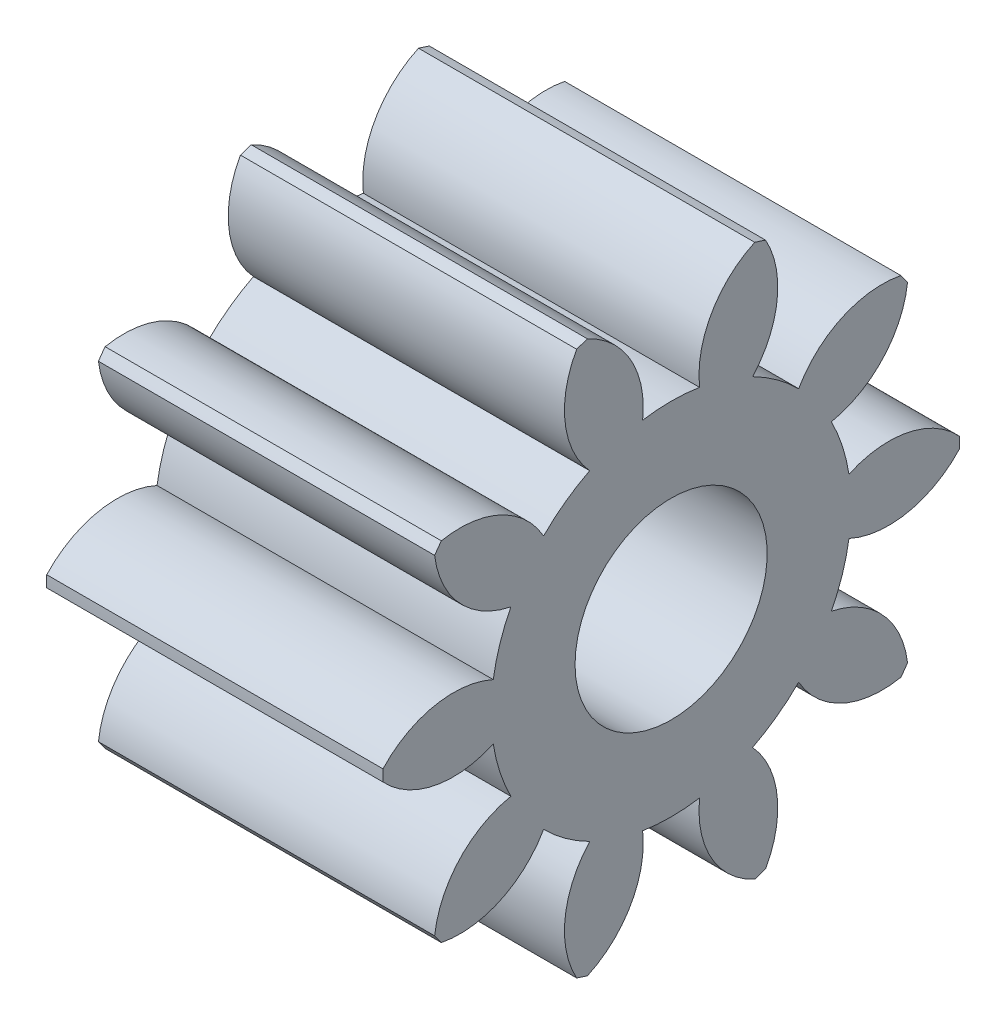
ISO-10303-21;
HEADER;
FILE_DESCRIPTION(('STEP AP214'),'2;1');
FILE_NAME('part.step','',(''),(''),'','','');
FILE_SCHEMA(('AUTOMOTIVE_DESIGN { 1 0 10303 214 1 1 1 1 }'));
ENDSEC;
DATA;
#1=APPLICATION_CONTEXT('core data for automotive mechanical design processes');
#2=APPLICATION_PROTOCOL_DEFINITION('international standard','automotive_design',2000,#1);
#3=PRODUCT_CONTEXT('',#1,'mechanical');
#4=PRODUCT('Part','Part','',(#3));
#5=PRODUCT_RELATED_PRODUCT_CATEGORY('part','',(#4));
#6=PRODUCT_DEFINITION_FORMATION('','',#4);
#7=PRODUCT_DEFINITION_CONTEXT('part definition',#1,'design');
#8=PRODUCT_DEFINITION('design','',#6,#7);
#9=PRODUCT_DEFINITION_SHAPE('','',#8);
#10=(LENGTH_UNIT() NAMED_UNIT(*) SI_UNIT(.MILLI.,.METRE.));
#11=(NAMED_UNIT(*) PLANE_ANGLE_UNIT() SI_UNIT($,.RADIAN.));
#12=(NAMED_UNIT(*) SI_UNIT($,.STERADIAN.) SOLID_ANGLE_UNIT());
#13=UNCERTAINTY_MEASURE_WITH_UNIT(LENGTH_MEASURE(1.E-05),#10,'distance_accuracy_value','');
#14=(GEOMETRIC_REPRESENTATION_CONTEXT(3) GLOBAL_UNCERTAINTY_ASSIGNED_CONTEXT((#13)) GLOBAL_UNIT_ASSIGNED_CONTEXT((#10,
#11,#12)) REPRESENTATION_CONTEXT('',''));
#15=CARTESIAN_POINT('',(0.,0.,0.));
#16=DIRECTION('',(0.,0.,1.));
#17=DIRECTION('',(1.,0.,0.));
#18=AXIS2_PLACEMENT_3D('',#15,#16,#17);
#19=CARTESIAN_POINT('',(3.5,0.,0.));
#20=DIRECTION('',(-1.,0.,0.));
#21=DIRECTION('',(0.,0.,1.));
#22=AXIS2_PLACEMENT_3D('',#19,#20,#21);
#23=PLANE('',#22);
#24=CARTESIAN_POINT('',(3.5,0.,0.));
#25=DIRECTION('',(-1.,0.,0.));
#26=DIRECTION('',(0.,0.,1.));
#27=AXIS2_PLACEMENT_3D('',#24,#25,#26);
#28=CIRCLE('',#27,1.);
#29=CARTESIAN_POINT('',(3.5,0.,1.));
#30=VERTEX_POINT('',#29);
#31=EDGE_CURVE('E352',#30,#30,#28,.F.);
#32=ORIENTED_EDGE('',*,*,#31,.F.);
#33=EDGE_LOOP('',(#32));
#34=FACE_BOUND('',#33,.T.);
#35=CARTESIAN_POINT('',(3.5,-0.62021278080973,-2.26588282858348));
#36=DIRECTION('',(-1.,0.,0.));
#37=DIRECTION('',(0.,-0.95105651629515,-0.309016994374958));
#38=AXIS2_PLACEMENT_3D('',#35,#36,#37);
#39=CIRCLE('',#38,0.999999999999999);
#40=CARTESIAN_POINT('',(3.5,0.289865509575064,-1.85144645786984));
#41=VERTEX_POINT('',#40);
#42=CARTESIAN_POINT('',(3.5,0.0594463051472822,-2.99941096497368));
#43=VERTEX_POINT('',#42);
#44=EDGE_CURVE('E358',#41,#43,#39,.T.);
#45=ORIENTED_EDGE('',*,*,#44,.F.);
#46=CARTESIAN_POINT('',(3.5,0.,0.));
#47=DIRECTION('',(-1.,0.,0.));
#48=DIRECTION('',(0.,-0.95105651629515,-0.309016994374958));
#49=AXIS2_PLACEMENT_3D('',#46,#47,#48);
#50=CIRCLE('',#49,1.874);
#51=CARTESIAN_POINT('',(3.5,0.85374680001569,-1.66823032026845));
#52=VERTEX_POINT('',#51);
#53=EDGE_CURVE('E363',#52,#41,#50,.T.);
#54=ORIENTED_EDGE('',*,*,#53,.F.);
#55=CARTESIAN_POINT('',(3.5,1.83361518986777,-1.46858578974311));
#56=DIRECTION('',(-1.,0.,0.));
#57=DIRECTION('',(0.,-0.95105651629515,-0.309016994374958));
#58=AXIS2_PLACEMENT_3D('',#55,#56,#57);
#59=CIRCLE('',#58,1.);
#60=CARTESIAN_POINT('',(3.5,1.71491645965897,-2.46151610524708));
#61=VERTEX_POINT('',#60);
#62=EDGE_CURVE('E360',#61,#52,#59,.T.);
#63=ORIENTED_EDGE('',*,*,#62,.F.);
#64=CARTESIAN_POINT('',(3.5,0.,0.));
#65=DIRECTION('',(-1.,0.,0.));
#66=DIRECTION('',(0.,0.,1.));
#67=AXIS2_PLACEMENT_3D('',#64,#65,#66);
#68=CIRCLE('',#67,3.);
#69=CARTESIAN_POINT('',(3.5,1.81110260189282,-2.39163278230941));
#70=VERTEX_POINT('',#69);
#71=EDGE_CURVE('E524',#70,#61,#68,.T.);
#72=ORIENTED_EDGE('',*,*,#71,.F.);
#73=CARTESIAN_POINT('',(3.5,0.830089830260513,-2.19768964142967));
#74=DIRECTION('',(-1.,0.,0.));
#75=DIRECTION('',(0.,-0.587785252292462,-0.809016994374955));
#76=AXIS2_PLACEMENT_3D('',#73,#74,#75);
#77=CIRCLE('',#76,0.999999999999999);
#78=CARTESIAN_POINT('',(3.5,1.32275904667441,-1.32747297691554));
#79=VERTEX_POINT('',#78);
#80=EDGE_CURVE('E343',#79,#70,#77,.T.);
#81=ORIENTED_EDGE('',*,*,#80,.F.);
#82=CARTESIAN_POINT('',(3.5,0.,0.));
#83=DIRECTION('',(-1.,0.,0.));
#84=DIRECTION('',(0.,-0.587785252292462,-0.809016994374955));
#85=AXIS2_PLACEMENT_3D('',#82,#83,#84);
#86=CIRCLE('',#85,1.874);
#87=CARTESIAN_POINT('',(3.5,1.67125684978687,-0.84780690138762));
#88=VERTEX_POINT('',#87);
#89=EDGE_CURVE('E348',#88,#79,#86,.T.);
#90=ORIENTED_EDGE('',*,*,#89,.F.);
#91=CARTESIAN_POINT('',(3.5,2.34663891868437,-0.110338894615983));
#92=DIRECTION('',(-1.,0.,0.));
#93=DIRECTION('',(0.,-0.587785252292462,-0.809016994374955));
#94=AXIS2_PLACEMENT_3D('',#91,#92,#93);
#95=CIRCLE('',#94,1.);
#96=CARTESIAN_POINT('',(3.5,2.83423942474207,-0.983405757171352));
#97=VERTEX_POINT('',#96);
#98=EDGE_CURVE('E345',#97,#88,#95,.T.);
#99=ORIENTED_EDGE('',*,*,#98,.F.);
#100=CARTESIAN_POINT('',(3.5,2.87097926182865,-0.870332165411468));
#101=VERTEX_POINT('',#100);
#102=EDGE_CURVE('E520',#101,#97,#68,.T.);
#103=ORIENTED_EDGE('',*,*,#102,.F.);
#104=CARTESIAN_POINT('',(3.5,1.96332633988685,-1.29005370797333));
#105=DIRECTION('',(-1.,0.,0.));
#106=DIRECTION('',(0.,0.,-1.));
#107=AXIS2_PLACEMENT_3D('',#104,#105,#106);
#108=CIRCLE('',#107,0.999999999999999);
#109=CARTESIAN_POINT('',(3.5,1.85040358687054,-0.296449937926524));
#110=VERTEX_POINT('',#109);
#111=EDGE_CURVE('E492',#110,#101,#108,.T.);
#112=ORIENTED_EDGE('',*,*,#111,.F.);
#113=CARTESIAN_POINT('',(3.5,0.,0.));
#114=DIRECTION('',(-1.,0.,0.));
#115=DIRECTION('',(0.,0.,-1.));
#116=AXIS2_PLACEMENT_3D('',#113,#114,#115);
#117=CIRCLE('',#116,1.874);
#118=CARTESIAN_POINT('',(3.5,1.85040358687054,0.296449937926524));
#119=VERTEX_POINT('',#118);
#120=EDGE_CURVE('E497',#119,#110,#117,.T.);
#121=ORIENTED_EDGE('',*,*,#120,.F.);
#122=CARTESIAN_POINT('',(3.5,1.96332633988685,1.29005370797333));
#123=DIRECTION('',(-1.,0.,0.));
#124=DIRECTION('',(0.,0.,-1.));
#125=AXIS2_PLACEMENT_3D('',#122,#123,#124);
#126=CIRCLE('',#125,1.);
#127=CARTESIAN_POINT('',(3.5,2.87097926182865,0.870332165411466));
#128=VERTEX_POINT('',#127);
#129=EDGE_CURVE('E494',#128,#119,#126,.T.);
#130=ORIENTED_EDGE('',*,*,#129,.F.);
#131=CARTESIAN_POINT('',(3.5,2.83423942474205,0.983405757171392));
#132=VERTEX_POINT('',#131);
#133=EDGE_CURVE('E517',#132,#128,#68,.T.);
#134=ORIENTED_EDGE('',*,*,#133,.F.);
#135=CARTESIAN_POINT('',(3.5,2.34663891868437,0.110338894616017));
#136=DIRECTION('',(-1.,0.,0.));
#137=DIRECTION('',(0.,0.587785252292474,-0.809016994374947));
#138=AXIS2_PLACEMENT_3D('',#135,#136,#137);
#139=CIRCLE('',#138,0.999999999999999);
#140=CARTESIAN_POINT('',(3.5,1.67125684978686,0.847806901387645));
#141=VERTEX_POINT('',#140);
#142=EDGE_CURVE('E470',#141,#132,#139,.T.);
#143=ORIENTED_EDGE('',*,*,#142,.F.);
#144=CARTESIAN_POINT('',(3.5,0.,0.));
#145=DIRECTION('',(-1.,0.,0.));
#146=DIRECTION('',(0.,0.587785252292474,-0.809016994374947));
#147=AXIS2_PLACEMENT_3D('',#144,#145,#146);
#148=CIRCLE('',#147,1.874);
#149=CARTESIAN_POINT('',(3.5,1.3227590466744,1.32747297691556));
#150=VERTEX_POINT('',#149);
#151=EDGE_CURVE('E475',#150,#141,#148,.T.);
#152=ORIENTED_EDGE('',*,*,#151,.F.);
#153=CARTESIAN_POINT('',(3.5,0.830089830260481,2.19768964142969));
#154=DIRECTION('',(-1.,0.,0.));
#155=DIRECTION('',(0.,0.587785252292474,-0.809016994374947));
#156=AXIS2_PLACEMENT_3D('',#153,#154,#155);
#157=CIRCLE('',#156,1.);
#158=CARTESIAN_POINT('',(3.5,1.81110260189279,2.39163278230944));
#159=VERTEX_POINT('',#158);
#160=EDGE_CURVE('E472',#159,#150,#157,.T.);
#161=ORIENTED_EDGE('',*,*,#160,.F.);
#162=CARTESIAN_POINT('',(3.5,1.71491645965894,2.4615161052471));
#163=VERTEX_POINT('',#162);
#164=EDGE_CURVE('E525',#163,#159,#68,.T.);
#165=ORIENTED_EDGE('',*,*,#164,.F.);
#166=CARTESIAN_POINT('',(3.5,1.83361518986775,1.46858578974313));
#167=DIRECTION('',(-1.,0.,0.));
#168=DIRECTION('',(0.,0.951056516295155,-0.309016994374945));
#169=AXIS2_PLACEMENT_3D('',#166,#167,#168);
#170=CIRCLE('',#169,0.999999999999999);
#171=CARTESIAN_POINT('',(3.5,0.853746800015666,1.66823032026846));
#172=VERTEX_POINT('',#171);
#173=EDGE_CURVE('E405',#172,#163,#170,.T.);
#174=ORIENTED_EDGE('',*,*,#173,.F.);
#175=CARTESIAN_POINT('',(3.5,0.,0.));
#176=DIRECTION('',(-1.,0.,0.));
#177=DIRECTION('',(0.,0.951056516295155,-0.309016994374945));
#178=AXIS2_PLACEMENT_3D('',#175,#176,#177);
#179=CIRCLE('',#178,1.874);
#180=CARTESIAN_POINT('',(3.5,0.289865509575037,1.85144645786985));
#181=VERTEX_POINT('',#180);
#182=EDGE_CURVE('E410',#181,#172,#179,.T.);
#183=ORIENTED_EDGE('',*,*,#182,.F.);
#184=CARTESIAN_POINT('',(3.5,-0.620212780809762,2.26588282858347));
#185=DIRECTION('',(-1.,0.,0.));
#186=DIRECTION('',(0.,0.951056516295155,-0.309016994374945));
#187=AXIS2_PLACEMENT_3D('',#184,#185,#186);
#188=CIRCLE('',#187,1.);
#189=CARTESIAN_POINT('',(3.5,0.0594463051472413,2.99941096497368));
#190=VERTEX_POINT('',#189);
#191=EDGE_CURVE('E407',#190,#181,#188,.T.);
#192=ORIENTED_EDGE('',*,*,#191,.F.);
#193=CARTESIAN_POINT('',(3.5,-0.0594463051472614,2.99941096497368));
#194=VERTEX_POINT('',#193);
#195=EDGE_CURVE('E688',#194,#190,#68,.T.);
#196=ORIENTED_EDGE('',*,*,#195,.F.);
#197=CARTESIAN_POINT('',(3.5,0.620212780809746,2.26588282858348));
#198=DIRECTION('',(-1.,0.,0.));
#199=DIRECTION('',(0.,0.951056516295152,0.309016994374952));
#200=AXIS2_PLACEMENT_3D('',#197,#198,#199);
#201=CIRCLE('',#200,0.999999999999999);
#202=CARTESIAN_POINT('',(3.5,-0.289865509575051,1.85144645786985));
#203=VERTEX_POINT('',#202);
#204=EDGE_CURVE('E424',#203,#194,#201,.T.);
#205=ORIENTED_EDGE('',*,*,#204,.F.);
#206=CARTESIAN_POINT('',(3.5,0.,0.));
#207=DIRECTION('',(-1.,0.,0.));
#208=DIRECTION('',(0.,0.951056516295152,0.309016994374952));
#209=AXIS2_PLACEMENT_3D('',#206,#207,#208);
#210=CIRCLE('',#209,1.874);
#211=CARTESIAN_POINT('',(3.5,-0.853746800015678,1.66823032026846));
#212=VERTEX_POINT('',#211);
#213=EDGE_CURVE('E429',#212,#203,#210,.T.);
#214=ORIENTED_EDGE('',*,*,#213,.F.);
#215=CARTESIAN_POINT('',(3.5,-1.83361518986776,1.46858578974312));
#216=DIRECTION('',(-1.,0.,0.));
#217=DIRECTION('',(0.,0.951056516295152,0.309016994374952));
#218=AXIS2_PLACEMENT_3D('',#215,#216,#217);
#219=CIRCLE('',#218,1.);
#220=CARTESIAN_POINT('',(3.5,-1.71491645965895,2.46151610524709));
#221=VERTEX_POINT('',#220);
#222=EDGE_CURVE('E426',#221,#212,#219,.T.);
#223=ORIENTED_EDGE('',*,*,#222,.F.);
#224=CARTESIAN_POINT('',(3.5,-1.8111026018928,2.39163278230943));
#225=VERTEX_POINT('',#224);
#226=EDGE_CURVE('E669',#225,#221,#68,.T.);
#227=ORIENTED_EDGE('',*,*,#226,.F.);
#228=CARTESIAN_POINT('',(3.5,-0.830089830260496,2.19768964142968));
#229=DIRECTION('',(-1.,0.,0.));
#230=DIRECTION('',(0.,0.587785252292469,0.809016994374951));
#231=AXIS2_PLACEMENT_3D('',#228,#229,#230);
#232=CIRCLE('',#231,0.999999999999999);
#233=CARTESIAN_POINT('',(3.5,-1.32275904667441,1.32747297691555));
#234=VERTEX_POINT('',#233);
#235=EDGE_CURVE('E388',#234,#225,#232,.T.);
#236=ORIENTED_EDGE('',*,*,#235,.F.);
#237=CARTESIAN_POINT('',(3.5,0.,0.));
#238=DIRECTION('',(-1.,0.,0.));
#239=DIRECTION('',(0.,0.587785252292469,0.809016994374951));
#240=AXIS2_PLACEMENT_3D('',#237,#238,#239);
#241=CIRCLE('',#240,1.874);
#242=CARTESIAN_POINT('',(3.5,-1.67125684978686,0.847806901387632));
#243=VERTEX_POINT('',#242);
#244=EDGE_CURVE('E393',#243,#234,#241,.T.);
#245=ORIENTED_EDGE('',*,*,#244,.F.);
#246=CARTESIAN_POINT('',(3.5,-2.34663891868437,0.110338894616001));
#247=DIRECTION('',(-1.,0.,0.));
#248=DIRECTION('',(0.,0.587785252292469,0.809016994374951));
#249=AXIS2_PLACEMENT_3D('',#246,#247,#248);
#250=CIRCLE('',#249,1.);
#251=CARTESIAN_POINT('',(3.5,-2.83423942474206,0.983405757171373));
#252=VERTEX_POINT('',#251);
#253=EDGE_CURVE('E390',#252,#243,#250,.T.);
#254=ORIENTED_EDGE('',*,*,#253,.F.);
#255=CARTESIAN_POINT('',(3.5,-2.87097926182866,0.870332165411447));
#256=VERTEX_POINT('',#255);
#257=EDGE_CURVE('E650',#256,#252,#68,.T.);
#258=ORIENTED_EDGE('',*,*,#257,.F.);
#259=CARTESIAN_POINT('',(3.5,-1.96332633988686,1.29005370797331));
#260=DIRECTION('',(-1.,0.,0.));
#261=DIRECTION('',(0.,0.,1.));
#262=AXIS2_PLACEMENT_3D('',#259,#260,#261);
#263=CIRCLE('',#262,0.999999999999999);
#264=CARTESIAN_POINT('',(3.5,-1.85040358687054,0.296449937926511));
#265=VERTEX_POINT('',#264);
#266=EDGE_CURVE('E371',#265,#256,#263,.T.);
#267=ORIENTED_EDGE('',*,*,#266,.F.);
#268=CARTESIAN_POINT('',(3.5,0.,0.));
#269=DIRECTION('',(-1.,0.,0.));
#270=DIRECTION('',(0.,0.,1.));
#271=AXIS2_PLACEMENT_3D('',#268,#269,#270);
#272=CIRCLE('',#271,1.874);
#273=CARTESIAN_POINT('',(3.5,-1.85040358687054,-0.296449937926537));
#274=VERTEX_POINT('',#273);
#275=EDGE_CURVE('E376',#274,#265,#272,.T.);
#276=ORIENTED_EDGE('',*,*,#275,.F.);
#277=CARTESIAN_POINT('',(3.5,-1.96332633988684,-1.29005370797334));
#278=DIRECTION('',(-1.,0.,0.));
#279=DIRECTION('',(0.,0.,1.));
#280=AXIS2_PLACEMENT_3D('',#277,#278,#279);
#281=CIRCLE('',#280,1.);
#282=CARTESIAN_POINT('',(3.5,-2.87097926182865,-0.870332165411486));
#283=VERTEX_POINT('',#282);
#284=EDGE_CURVE('E373',#283,#274,#281,.T.);
#285=ORIENTED_EDGE('',*,*,#284,.F.);
#286=CARTESIAN_POINT('',(3.5,-2.83423942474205,-0.983405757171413));
#287=VERTEX_POINT('',#286);
#288=EDGE_CURVE('E631',#287,#283,#68,.T.);
#289=ORIENTED_EDGE('',*,*,#288,.F.);
#290=CARTESIAN_POINT('',(3.5,-2.34663891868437,-0.110338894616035));
#291=DIRECTION('',(-1.,0.,0.));
#292=DIRECTION('',(0.,-0.58778525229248,0.809016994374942));
#293=AXIS2_PLACEMENT_3D('',#290,#291,#292);
#294=CIRCLE('',#293,0.999999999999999);
#295=CARTESIAN_POINT('',(3.5,-1.67125684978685,-0.847806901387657));
#296=VERTEX_POINT('',#295);
#297=EDGE_CURVE('E326',#296,#287,#294,.T.);
#298=ORIENTED_EDGE('',*,*,#297,.F.);
#299=CARTESIAN_POINT('',(3.5,0.,0.));
#300=DIRECTION('',(-1.,0.,0.));
#301=DIRECTION('',(0.,-0.58778525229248,0.809016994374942));
#302=AXIS2_PLACEMENT_3D('',#299,#300,#301);
#303=CIRCLE('',#302,1.874);
#304=CARTESIAN_POINT('',(3.5,-1.32275904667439,-1.32747297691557));
#305=VERTEX_POINT('',#304);
#306=EDGE_CURVE('E331',#305,#296,#303,.T.);
#307=ORIENTED_EDGE('',*,*,#306,.F.);
#308=CARTESIAN_POINT('',(3.5,-0.830089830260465,-2.19768964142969));
#309=DIRECTION('',(-1.,0.,0.));
#310=DIRECTION('',(0.,-0.58778525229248,0.809016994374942));
#311=AXIS2_PLACEMENT_3D('',#308,#309,#310);
#312=CIRCLE('',#311,1.);
#313=CARTESIAN_POINT('',(3.5,-1.81110260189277,-2.39163278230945));
#314=VERTEX_POINT('',#313);
#315=EDGE_CURVE('E328',#314,#305,#312,.T.);
#316=ORIENTED_EDGE('',*,*,#315,.F.);
#317=CARTESIAN_POINT('',(3.5,-1.71491645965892,-2.46151610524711));
#318=VERTEX_POINT('',#317);
#319=EDGE_CURVE('E612',#318,#314,#68,.T.);
#320=ORIENTED_EDGE('',*,*,#319,.F.);
#321=CARTESIAN_POINT('',(3.5,-1.83361518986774,-1.46858578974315));
#322=DIRECTION('',(-1.,0.,0.));
#323=DIRECTION('',(0.,-0.951056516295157,0.309016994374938));
#324=AXIS2_PLACEMENT_3D('',#321,#322,#323);
#325=CIRCLE('',#324,0.999999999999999);
#326=CARTESIAN_POINT('',(3.5,-0.853746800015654,-1.66823032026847));
#327=VERTEX_POINT('',#326);
#328=EDGE_CURVE('E302',#327,#318,#325,.T.);
#329=ORIENTED_EDGE('',*,*,#328,.F.);
#330=CARTESIAN_POINT('',(3.5,0.,0.));
#331=DIRECTION('',(-1.,0.,0.));
#332=DIRECTION('',(0.,-0.951056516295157,0.309016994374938));
#333=AXIS2_PLACEMENT_3D('',#330,#331,#332);
#334=CIRCLE('',#333,1.874);
#335=CARTESIAN_POINT('',(3.5,-0.289865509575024,-1.85144645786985));
#336=VERTEX_POINT('',#335);
#337=EDGE_CURVE('E301',#336,#327,#334,.T.);
#338=ORIENTED_EDGE('',*,*,#337,.F.);
#339=CARTESIAN_POINT('',(3.5,0.620212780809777,-2.26588282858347));
#340=DIRECTION('',(-1.,0.,0.));
#341=DIRECTION('',(0.,-0.951056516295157,0.309016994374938));
#342=AXIS2_PLACEMENT_3D('',#339,#340,#341);
#343=CIRCLE('',#342,1.);
#344=CARTESIAN_POINT('',(3.5,-0.0594463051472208,-2.99941096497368));
#345=VERTEX_POINT('',#344);
#346=EDGE_CURVE('E290',#345,#336,#343,.T.);
#347=ORIENTED_EDGE('',*,*,#346,.F.);
#348=EDGE_CURVE('E748',#43,#345,#68,.T.);
#349=ORIENTED_EDGE('',*,*,#348,.F.);
#350=EDGE_LOOP('',(#45,#54,#63,#72,#81,#90,#99,#103,#112,#121,#130,#134,#143,#152,#161,#165,
#174,#183,#192,#196,#205,#214,#223,#227,#236,#245,#254,#258,#267,#276,#285,#289,#298,#307,#316,
#320,#329,#338,#347,#349));
#351=FACE_BOUND('',#350,.T.);
#352=ADVANCED_FACE('F33',(#34,#351),#23,.F.);
#353=CARTESIAN_POINT('',(-10.,0.,0.));
#354=DIRECTION('',(-1.,0.,0.));
#355=DIRECTION('',(0.,0.,1.));
#356=AXIS2_PLACEMENT_3D('',#353,#354,#355);
#357=CYLINDRICAL_SURFACE('',#356,3.);
#358=DIRECTION('',(-1.,0.,0.));
#359=VECTOR('',#358,1.);
#360=CARTESIAN_POINT('',(1.75,0.0594463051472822,-2.99941096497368));
#361=LINE('',#360,#359);
#362=CARTESIAN_POINT('',(0.,0.0594463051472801,-2.99941096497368));
#363=VERTEX_POINT('',#362);
#364=EDGE_CURVE('E467',#43,#363,#361,.T.);
#365=ORIENTED_EDGE('',*,*,#364,.F.);
#366=ORIENTED_EDGE('',*,*,#348,.T.);
#367=DIRECTION('',(-1.,0.,0.));
#368=VECTOR('',#367,1.);
#369=CARTESIAN_POINT('',(1.75,-0.0594463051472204,-2.99941096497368));
#370=LINE('',#369,#368);
#371=CARTESIAN_POINT('',(0.,-0.0594463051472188,-2.99941096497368));
#372=VERTEX_POINT('',#371);
#373=EDGE_CURVE('E296',#372,#345,#370,.F.);
#374=ORIENTED_EDGE('',*,*,#373,.F.);
#375=CARTESIAN_POINT('',(0.,0.,0.));
#376=DIRECTION('',(-1.,0.,0.));
#377=DIRECTION('',(0.,0.,1.));
#378=AXIS2_PLACEMENT_3D('',#375,#376,#377);
#379=CIRCLE('',#378,3.);
#380=EDGE_CURVE('E582',#363,#372,#379,.T.);
#381=ORIENTED_EDGE('',*,*,#380,.F.);
#382=EDGE_LOOP('',(#365,#366,#374,#381));
#383=FACE_BOUND('',#382,.T.);
#384=ADVANCED_FACE('F733',(#383),#357,.T.);
#385=DIRECTION('',(-1.,0.,0.));
#386=VECTOR('',#385,1.);
#387=CARTESIAN_POINT('',(1.75,1.71491645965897,-2.46151610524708));
#388=LINE('',#387,#386);
#389=CARTESIAN_POINT('',(0.,1.71491645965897,-2.46151610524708));
#390=VERTEX_POINT('',#389);
#391=EDGE_CURVE('E465',#390,#61,#388,.F.);
#392=ORIENTED_EDGE('',*,*,#391,.F.);
#393=CARTESIAN_POINT('',(0.,1.81110260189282,-2.39163278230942));
#394=VERTEX_POINT('',#393);
#395=EDGE_CURVE('E518',#394,#390,#379,.T.);
#396=ORIENTED_EDGE('',*,*,#395,.F.);
#397=DIRECTION('',(-1.,0.,0.));
#398=VECTOR('',#397,1.);
#399=CARTESIAN_POINT('',(1.75,1.81110260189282,-2.39163278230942));
#400=LINE('',#399,#398);
#401=EDGE_CURVE('E463',#70,#394,#400,.T.);
#402=ORIENTED_EDGE('',*,*,#401,.F.);
#403=ORIENTED_EDGE('',*,*,#71,.T.);
#404=EDGE_LOOP('',(#392,#396,#402,#403));
#405=FACE_BOUND('',#404,.T.);
#406=ADVANCED_FACE('F579',(#405),#357,.T.);
#407=DIRECTION('',(-1.,0.,0.));
#408=VECTOR('',#407,1.);
#409=CARTESIAN_POINT('',(1.75,2.83423942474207,-0.983405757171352));
#410=LINE('',#409,#408);
#411=CARTESIAN_POINT('',(0.,2.83423942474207,-0.983405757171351));
#412=VERTEX_POINT('',#411);
#413=EDGE_CURVE('E461',#412,#97,#410,.F.);
#414=ORIENTED_EDGE('',*,*,#413,.F.);
#415=CARTESIAN_POINT('',(0.,2.87097926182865,-0.87033216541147));
#416=VERTEX_POINT('',#415);
#417=EDGE_CURVE('E514',#416,#412,#379,.T.);
#418=ORIENTED_EDGE('',*,*,#417,.F.);
#419=DIRECTION('',(-1.,0.,0.));
#420=VECTOR('',#419,1.);
#421=CARTESIAN_POINT('',(1.75,2.87097926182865,-0.870332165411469));
#422=LINE('',#421,#420);
#423=EDGE_CURVE('E511',#101,#416,#422,.T.);
#424=ORIENTED_EDGE('',*,*,#423,.F.);
#425=ORIENTED_EDGE('',*,*,#102,.T.);
#426=EDGE_LOOP('',(#414,#418,#424,#425));
#427=FACE_BOUND('',#426,.T.);
#428=ADVANCED_FACE('F553',(#427),#357,.T.);
#429=DIRECTION('',(-1.,0.,0.));
#430=VECTOR('',#429,1.);
#431=CARTESIAN_POINT('',(1.75,-2.83423942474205,-0.983405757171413));
#432=LINE('',#431,#430);
#433=CARTESIAN_POINT('',(0.,-2.83423942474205,-0.983405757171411));
#434=VERTEX_POINT('',#433);
#435=EDGE_CURVE('E459',#287,#434,#432,.T.);
#436=ORIENTED_EDGE('',*,*,#435,.F.);
#437=ORIENTED_EDGE('',*,*,#288,.T.);
#438=DIRECTION('',(-1.,0.,0.));
#439=VECTOR('',#438,1.);
#440=CARTESIAN_POINT('',(1.75,-2.87097926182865,-0.870332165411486));
#441=LINE('',#440,#439);
#442=CARTESIAN_POINT('',(0.,-2.87097926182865,-0.870332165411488));
#443=VERTEX_POINT('',#442);
#444=EDGE_CURVE('E442',#443,#283,#441,.F.);
#445=ORIENTED_EDGE('',*,*,#444,.F.);
#446=EDGE_CURVE('E598',#434,#443,#379,.T.);
#447=ORIENTED_EDGE('',*,*,#446,.F.);
#448=EDGE_LOOP('',(#436,#437,#445,#447));
#449=FACE_BOUND('',#448,.T.);
#450=ADVANCED_FACE('F629',(#449),#357,.T.);
#451=DIRECTION('',(-1.,0.,0.));
#452=VECTOR('',#451,1.);
#453=CARTESIAN_POINT('',(1.75,-1.81110260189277,-2.39163278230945));
#454=LINE('',#453,#452);
#455=CARTESIAN_POINT('',(0.,-1.81110260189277,-2.39163278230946));
#456=VERTEX_POINT('',#455);
#457=EDGE_CURVE('E457',#456,#314,#454,.F.);
#458=ORIENTED_EDGE('',*,*,#457,.F.);
#459=CARTESIAN_POINT('',(0.,-1.71491645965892,-2.46151610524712));
#460=VERTEX_POINT('',#459);
#461=EDGE_CURVE('E584',#460,#456,#379,.T.);
#462=ORIENTED_EDGE('',*,*,#461,.F.);
#463=DIRECTION('',(-1.,0.,0.));
#464=VECTOR('',#463,1.);
#465=CARTESIAN_POINT('',(1.75,-1.71491645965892,-2.46151610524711));
#466=LINE('',#465,#464);
#467=EDGE_CURVE('E455',#318,#460,#466,.T.);
#468=ORIENTED_EDGE('',*,*,#467,.F.);
#469=ORIENTED_EDGE('',*,*,#319,.T.);
#470=EDGE_LOOP('',(#458,#462,#468,#469));
#471=FACE_BOUND('',#470,.T.);
#472=ADVANCED_FACE('F610',(#471),#357,.T.);
#473=DIRECTION('',(-1.,0.,0.));
#474=VECTOR('',#473,1.);
#475=CARTESIAN_POINT('',(1.75,1.71491645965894,2.4615161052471));
#476=LINE('',#475,#474);
#477=CARTESIAN_POINT('',(0.,1.71491645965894,2.4615161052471));
#478=VERTEX_POINT('',#477);
#479=EDGE_CURVE('E452',#163,#478,#476,.T.);
#480=ORIENTED_EDGE('',*,*,#479,.F.);
#481=ORIENTED_EDGE('',*,*,#164,.T.);
#482=DIRECTION('',(-1.,0.,0.));
#483=VECTOR('',#482,1.);
#484=CARTESIAN_POINT('',(1.75,1.81110260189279,2.39163278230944));
#485=LINE('',#484,#483);
#486=CARTESIAN_POINT('',(0.,1.81110260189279,2.39163278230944));
#487=VERTEX_POINT('',#486);
#488=EDGE_CURVE('E486',#487,#159,#485,.F.);
#489=ORIENTED_EDGE('',*,*,#488,.F.);
#490=EDGE_CURVE('E519',#478,#487,#379,.T.);
#491=ORIENTED_EDGE('',*,*,#490,.F.);
#492=EDGE_LOOP('',(#480,#481,#489,#491));
#493=FACE_BOUND('',#492,.T.);
#494=ADVANCED_FACE('F705',(#493),#357,.T.);
#495=DIRECTION('',(-1.,0.,0.));
#496=VECTOR('',#495,1.);
#497=CARTESIAN_POINT('',(1.75,0.0594463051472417,2.99941096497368));
#498=LINE('',#497,#496);
#499=CARTESIAN_POINT('',(0.,0.0594463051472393,2.99941096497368));
#500=VERTEX_POINT('',#499);
#501=EDGE_CURVE('E450',#500,#190,#498,.F.);
#502=ORIENTED_EDGE('',*,*,#501,.F.);
#503=CARTESIAN_POINT('',(0.,-0.0594463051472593,2.99941096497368));
#504=VERTEX_POINT('',#503);
#505=EDGE_CURVE('E586',#504,#500,#379,.T.);
#506=ORIENTED_EDGE('',*,*,#505,.F.);
#507=DIRECTION('',(-1.,0.,0.));
#508=VECTOR('',#507,1.);
#509=CARTESIAN_POINT('',(1.75,-0.0594463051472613,2.99941096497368));
#510=LINE('',#509,#508);
#511=EDGE_CURVE('E448',#194,#504,#510,.T.);
#512=ORIENTED_EDGE('',*,*,#511,.F.);
#513=ORIENTED_EDGE('',*,*,#195,.T.);
#514=EDGE_LOOP('',(#502,#506,#512,#513));
#515=FACE_BOUND('',#514,.T.);
#516=ADVANCED_FACE('F686',(#515),#357,.T.);
#517=DIRECTION('',(-1.,0.,0.));
#518=VECTOR('',#517,1.);
#519=CARTESIAN_POINT('',(1.75,-1.71491645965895,2.46151610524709));
#520=LINE('',#519,#518);
#521=CARTESIAN_POINT('',(0.,-1.71491645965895,2.46151610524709));
#522=VERTEX_POINT('',#521);
#523=EDGE_CURVE('E446',#522,#221,#520,.F.);
#524=ORIENTED_EDGE('',*,*,#523,.F.);
#525=CARTESIAN_POINT('',(0.,-1.8111026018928,2.39163278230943));
#526=VERTEX_POINT('',#525);
#527=EDGE_CURVE('E590',#526,#522,#379,.T.);
#528=ORIENTED_EDGE('',*,*,#527,.F.);
#529=DIRECTION('',(-1.,0.,0.));
#530=VECTOR('',#529,1.);
#531=CARTESIAN_POINT('',(1.75,-1.8111026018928,2.39163278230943));
#532=LINE('',#531,#530);
#533=EDGE_CURVE('E440',#225,#526,#532,.T.);
#534=ORIENTED_EDGE('',*,*,#533,.F.);
#535=ORIENTED_EDGE('',*,*,#226,.T.);
#536=EDGE_LOOP('',(#524,#528,#534,#535));
#537=FACE_BOUND('',#536,.T.);
#538=ADVANCED_FACE('F667',(#537),#357,.T.);
#539=DIRECTION('',(-1.,0.,0.));
#540=VECTOR('',#539,1.);
#541=CARTESIAN_POINT('',(1.75,-2.87097926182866,0.870332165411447));
#542=LINE('',#541,#540);
#543=CARTESIAN_POINT('',(0.,-2.87097926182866,0.87033216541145));
#544=VERTEX_POINT('',#543);
#545=EDGE_CURVE('E444',#256,#544,#542,.T.);
#546=ORIENTED_EDGE('',*,*,#545,.F.);
#547=ORIENTED_EDGE('',*,*,#257,.T.);
#548=DIRECTION('',(-1.,0.,0.));
#549=VECTOR('',#548,1.);
#550=CARTESIAN_POINT('',(1.75,-2.83423942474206,0.983405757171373));
#551=LINE('',#550,#549);
#552=CARTESIAN_POINT('',(0.,-2.83423942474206,0.983405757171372));
#553=VERTEX_POINT('',#552);
#554=EDGE_CURVE('E423',#553,#252,#551,.F.);
#555=ORIENTED_EDGE('',*,*,#554,.F.);
#556=EDGE_CURVE('E594',#544,#553,#379,.T.);
#557=ORIENTED_EDGE('',*,*,#556,.F.);
#558=EDGE_LOOP('',(#546,#547,#555,#557));
#559=FACE_BOUND('',#558,.T.);
#560=ADVANCED_FACE('F648',(#559),#357,.T.);
#561=CARTESIAN_POINT('',(0.,0.,0.));
#562=DIRECTION('',(1.,0.,0.));
#563=DIRECTION('',(0.,0.,-1.));
#564=AXIS2_PLACEMENT_3D('',#561,#562,#563);
#565=PLANE('',#564);
#566=CARTESIAN_POINT('',(0.,0.,0.));
#567=DIRECTION('',(1.,0.,0.));
#568=DIRECTION('',(0.,0.,-1.));
#569=AXIS2_PLACEMENT_3D('',#566,#567,#568);
#570=CIRCLE('',#569,1.);
#571=CARTESIAN_POINT('',(0.,0.,-1.));
#572=VERTEX_POINT('',#571);
#573=EDGE_CURVE('E36',#572,#572,#570,.F.);
#574=ORIENTED_EDGE('',*,*,#573,.F.);
#575=EDGE_LOOP('',(#574));
#576=FACE_BOUND('',#575,.T.);
#577=CARTESIAN_POINT('',(0.,-0.62021278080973,-2.26588282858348));
#578=DIRECTION('',(-1.,0.,0.));
#579=DIRECTION('',(0.,-0.95105651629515,-0.309016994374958));
#580=AXIS2_PLACEMENT_3D('',#577,#578,#579);
#581=CIRCLE('',#580,0.999999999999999);
#582=CARTESIAN_POINT('',(0.,0.289865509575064,-1.85144645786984));
#583=VERTEX_POINT('',#582);
#584=EDGE_CURVE('E48',#583,#363,#581,.T.);
#585=ORIENTED_EDGE('',*,*,#584,.T.);
#586=ORIENTED_EDGE('',*,*,#380,.T.);
#587=CARTESIAN_POINT('',(0.,0.620212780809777,-2.26588282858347));
#588=DIRECTION('',(1.,0.,0.));
#589=DIRECTION('',(0.,0.,-1.));
#590=AXIS2_PLACEMENT_3D('',#587,#588,#589);
#591=CIRCLE('',#590,1.);
#592=CARTESIAN_POINT('',(0.,-0.289865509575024,-1.85144645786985));
#593=VERTEX_POINT('',#592);
#594=EDGE_CURVE('E539',#593,#372,#591,.T.);
#595=ORIENTED_EDGE('',*,*,#594,.F.);
#596=CARTESIAN_POINT('',(0.,0.,0.));
#597=DIRECTION('',(-1.,0.,0.));
#598=DIRECTION('',(0.,-0.951056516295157,0.309016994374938));
#599=AXIS2_PLACEMENT_3D('',#596,#597,#598);
#600=CIRCLE('',#599,1.874);
#601=CARTESIAN_POINT('',(0.,-0.853746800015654,-1.66823032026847));
#602=VERTEX_POINT('',#601);
#603=EDGE_CURVE('E309',#593,#602,#600,.T.);
#604=ORIENTED_EDGE('',*,*,#603,.T.);
#605=CARTESIAN_POINT('',(0.,-1.83361518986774,-1.46858578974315));
#606=DIRECTION('',(-1.,0.,0.));
#607=DIRECTION('',(0.,-0.951056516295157,0.309016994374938));
#608=AXIS2_PLACEMENT_3D('',#605,#606,#607);
#609=CIRCLE('',#608,0.999999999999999);
#610=EDGE_CURVE('E321',#602,#460,#609,.T.);
#611=ORIENTED_EDGE('',*,*,#610,.T.);
#612=ORIENTED_EDGE('',*,*,#461,.T.);
#613=CARTESIAN_POINT('',(0.,-0.830089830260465,-2.19768964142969));
#614=DIRECTION('',(1.,0.,0.));
#615=DIRECTION('',(0.,0.,-1.));
#616=AXIS2_PLACEMENT_3D('',#613,#614,#615);
#617=CIRCLE('',#616,1.);
#618=CARTESIAN_POINT('',(0.,-1.32275904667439,-1.32747297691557));
#619=VERTEX_POINT('',#618);
#620=EDGE_CURVE('E541',#619,#456,#617,.T.);
#621=ORIENTED_EDGE('',*,*,#620,.F.);
#622=CARTESIAN_POINT('',(0.,0.,0.));
#623=DIRECTION('',(-1.,0.,0.));
#624=DIRECTION('',(0.,-0.58778525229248,0.809016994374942));
#625=AXIS2_PLACEMENT_3D('',#622,#623,#624);
#626=CIRCLE('',#625,1.874);
#627=CARTESIAN_POINT('',(0.,-1.67125684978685,-0.847806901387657));
#628=VERTEX_POINT('',#627);
#629=EDGE_CURVE('E329',#619,#628,#626,.T.);
#630=ORIENTED_EDGE('',*,*,#629,.T.);
#631=CARTESIAN_POINT('',(0.,-2.34663891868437,-0.110338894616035));
#632=DIRECTION('',(-1.,0.,0.));
#633=DIRECTION('',(0.,-0.58778525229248,0.809016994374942));
#634=AXIS2_PLACEMENT_3D('',#631,#632,#633);
#635=CIRCLE('',#634,0.999999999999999);
#636=EDGE_CURVE('E311',#628,#434,#635,.T.);
#637=ORIENTED_EDGE('',*,*,#636,.T.);
#638=ORIENTED_EDGE('',*,*,#446,.T.);
#639=CARTESIAN_POINT('',(0.,-1.96332633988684,-1.29005370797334));
#640=DIRECTION('',(1.,0.,0.));
#641=DIRECTION('',(0.,0.,-1.));
#642=AXIS2_PLACEMENT_3D('',#639,#640,#641);
#643=CIRCLE('',#642,1.);
#644=CARTESIAN_POINT('',(0.,-1.85040358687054,-0.296449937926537));
#645=VERTEX_POINT('',#644);
#646=EDGE_CURVE('E533',#645,#443,#643,.T.);
#647=ORIENTED_EDGE('',*,*,#646,.F.);
#648=CARTESIAN_POINT('',(0.,0.,0.));
#649=DIRECTION('',(-1.,0.,0.));
#650=DIRECTION('',(0.,0.,1.));
#651=AXIS2_PLACEMENT_3D('',#648,#649,#650);
#652=CIRCLE('',#651,1.874);
#653=CARTESIAN_POINT('',(0.,-1.85040358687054,0.296449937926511));
#654=VERTEX_POINT('',#653);
#655=EDGE_CURVE('E374',#645,#654,#652,.T.);
#656=ORIENTED_EDGE('',*,*,#655,.T.);
#657=CARTESIAN_POINT('',(0.,-1.96332633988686,1.29005370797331));
#658=DIRECTION('',(-1.,0.,0.));
#659=DIRECTION('',(0.,0.,1.));
#660=AXIS2_PLACEMENT_3D('',#657,#658,#659);
#661=CIRCLE('',#660,0.999999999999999);
#662=EDGE_CURVE('E342',#654,#544,#661,.T.);
#663=ORIENTED_EDGE('',*,*,#662,.T.);
#664=ORIENTED_EDGE('',*,*,#556,.T.);
#665=CARTESIAN_POINT('',(0.,-2.34663891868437,0.110338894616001));
#666=DIRECTION('',(1.,0.,0.));
#667=DIRECTION('',(0.,0.,-1.));
#668=AXIS2_PLACEMENT_3D('',#665,#666,#667);
#669=CIRCLE('',#668,1.);
#670=CARTESIAN_POINT('',(0.,-1.67125684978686,0.847806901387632));
#671=VERTEX_POINT('',#670);
#672=EDGE_CURVE('E531',#671,#553,#669,.T.);
#673=ORIENTED_EDGE('',*,*,#672,.F.);
#674=CARTESIAN_POINT('',(0.,0.,0.));
#675=DIRECTION('',(-1.,0.,0.));
#676=DIRECTION('',(0.,0.587785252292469,0.809016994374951));
#677=AXIS2_PLACEMENT_3D('',#674,#675,#676);
#678=CIRCLE('',#677,1.874);
#679=CARTESIAN_POINT('',(0.,-1.32275904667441,1.32747297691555));
#680=VERTEX_POINT('',#679);
#681=EDGE_CURVE('E391',#671,#680,#678,.T.);
#682=ORIENTED_EDGE('',*,*,#681,.T.);
#683=CARTESIAN_POINT('',(0.,-0.830089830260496,2.19768964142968));
#684=DIRECTION('',(-1.,0.,0.));
#685=DIRECTION('',(0.,0.587785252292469,0.809016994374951));
#686=AXIS2_PLACEMENT_3D('',#683,#684,#685);
#687=CIRCLE('',#686,0.999999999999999);
#688=EDGE_CURVE('E387',#680,#526,#687,.T.);
#689=ORIENTED_EDGE('',*,*,#688,.T.);
#690=ORIENTED_EDGE('',*,*,#527,.T.);
#691=CARTESIAN_POINT('',(0.,-1.83361518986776,1.46858578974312));
#692=DIRECTION('',(1.,0.,0.));
#693=DIRECTION('',(0.,0.,-1.));
#694=AXIS2_PLACEMENT_3D('',#691,#692,#693);
#695=CIRCLE('',#694,1.);
#696=CARTESIAN_POINT('',(0.,-0.853746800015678,1.66823032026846));
#697=VERTEX_POINT('',#696);
#698=EDGE_CURVE('E535',#697,#522,#695,.T.);
#699=ORIENTED_EDGE('',*,*,#698,.F.);
#700=CARTESIAN_POINT('',(0.,0.,0.));
#701=DIRECTION('',(-1.,0.,0.));
#702=DIRECTION('',(0.,0.951056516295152,0.309016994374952));
#703=AXIS2_PLACEMENT_3D('',#700,#701,#702);
#704=CIRCLE('',#703,1.874);
#705=CARTESIAN_POINT('',(0.,-0.289865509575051,1.85144645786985));
#706=VERTEX_POINT('',#705);
#707=EDGE_CURVE('E427',#697,#706,#704,.T.);
#708=ORIENTED_EDGE('',*,*,#707,.T.);
#709=CARTESIAN_POINT('',(0.,0.620212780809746,2.26588282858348));
#710=DIRECTION('',(-1.,0.,0.));
#711=DIRECTION('',(0.,0.951056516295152,0.309016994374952));
#712=AXIS2_PLACEMENT_3D('',#709,#710,#711);
#713=CIRCLE('',#712,0.999999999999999);
#714=EDGE_CURVE('E404',#706,#504,#713,.T.);
#715=ORIENTED_EDGE('',*,*,#714,.T.);
#716=ORIENTED_EDGE('',*,*,#505,.T.);
#717=CARTESIAN_POINT('',(0.,-0.620212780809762,2.26588282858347));
#718=DIRECTION('',(1.,0.,0.));
#719=DIRECTION('',(0.,0.,-1.));
#720=AXIS2_PLACEMENT_3D('',#717,#718,#719);
#721=CIRCLE('',#720,1.);
#722=CARTESIAN_POINT('',(0.,0.289865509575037,1.85144645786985));
#723=VERTEX_POINT('',#722);
#724=EDGE_CURVE('E537',#723,#500,#721,.T.);
#725=ORIENTED_EDGE('',*,*,#724,.F.);
#726=CARTESIAN_POINT('',(0.,0.,0.));
#727=DIRECTION('',(-1.,0.,0.));
#728=DIRECTION('',(0.,0.951056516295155,-0.309016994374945));
#729=AXIS2_PLACEMENT_3D('',#726,#727,#728);
#730=CIRCLE('',#729,1.874);
#731=CARTESIAN_POINT('',(0.,0.853746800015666,1.66823032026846));
#732=VERTEX_POINT('',#731);
#733=EDGE_CURVE('E408',#723,#732,#730,.T.);
#734=ORIENTED_EDGE('',*,*,#733,.T.);
#735=CARTESIAN_POINT('',(0.,1.83361518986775,1.46858578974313));
#736=DIRECTION('',(-1.,0.,0.));
#737=DIRECTION('',(0.,0.951056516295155,-0.309016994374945));
#738=AXIS2_PLACEMENT_3D('',#735,#736,#737);
#739=CIRCLE('',#738,0.999999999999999);
#740=EDGE_CURVE('E413',#732,#478,#739,.T.);
#741=ORIENTED_EDGE('',*,*,#740,.T.);
#742=ORIENTED_EDGE('',*,*,#490,.T.);
#743=CARTESIAN_POINT('',(0.,0.830089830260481,2.19768964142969));
#744=DIRECTION('',(1.,0.,0.));
#745=DIRECTION('',(0.,0.,-1.));
#746=AXIS2_PLACEMENT_3D('',#743,#744,#745);
#747=CIRCLE('',#746,1.);
#748=CARTESIAN_POINT('',(0.,1.3227590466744,1.32747297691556));
#749=VERTEX_POINT('',#748);
#750=EDGE_CURVE('E528',#749,#487,#747,.T.);
#751=ORIENTED_EDGE('',*,*,#750,.F.);
#752=CARTESIAN_POINT('',(0.,0.,0.));
#753=DIRECTION('',(-1.,0.,0.));
#754=DIRECTION('',(0.,0.587785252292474,-0.809016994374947));
#755=AXIS2_PLACEMENT_3D('',#752,#753,#754);
#756=CIRCLE('',#755,1.874);
#757=CARTESIAN_POINT('',(0.,1.67125684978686,0.847806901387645));
#758=VERTEX_POINT('',#757);
#759=EDGE_CURVE('E473',#749,#758,#756,.T.);
#760=ORIENTED_EDGE('',*,*,#759,.T.);
#761=CARTESIAN_POINT('',(0.,2.34663891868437,0.110338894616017));
#762=DIRECTION('',(-1.,0.,0.));
#763=DIRECTION('',(0.,0.587785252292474,-0.809016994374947));
#764=AXIS2_PLACEMENT_3D('',#761,#762,#763);
#765=CIRCLE('',#764,0.999999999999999);
#766=CARTESIAN_POINT('',(0.,2.83423942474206,0.983405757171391));
#767=VERTEX_POINT('',#766);
#768=EDGE_CURVE('E469',#758,#767,#765,.T.);
#769=ORIENTED_EDGE('',*,*,#768,.T.);
#770=CARTESIAN_POINT('',(0.,2.87097926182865,0.870332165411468));
#771=VERTEX_POINT('',#770);
#772=EDGE_CURVE('E513',#767,#771,#379,.T.);
#773=ORIENTED_EDGE('',*,*,#772,.T.);
#774=CARTESIAN_POINT('',(0.,1.96332633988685,1.29005370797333));
#775=DIRECTION('',(1.,0.,0.));
#776=DIRECTION('',(0.,0.,-1.));
#777=AXIS2_PLACEMENT_3D('',#774,#775,#776);
#778=CIRCLE('',#777,1.);
#779=CARTESIAN_POINT('',(0.,1.85040358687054,0.296449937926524));
#780=VERTEX_POINT('',#779);
#781=EDGE_CURVE('E523',#780,#771,#778,.T.);
#782=ORIENTED_EDGE('',*,*,#781,.F.);
#783=CARTESIAN_POINT('',(0.,0.,0.));
#784=DIRECTION('',(-1.,0.,0.));
#785=DIRECTION('',(0.,0.,-1.));
#786=AXIS2_PLACEMENT_3D('',#783,#784,#785);
#787=CIRCLE('',#786,1.874);
#788=CARTESIAN_POINT('',(0.,1.85040358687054,-0.296449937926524));
#789=VERTEX_POINT('',#788);
#790=EDGE_CURVE('E495',#780,#789,#787,.T.);
#791=ORIENTED_EDGE('',*,*,#790,.T.);
#792=CARTESIAN_POINT('',(0.,1.96332633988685,-1.29005370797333));
#793=DIRECTION('',(-1.,0.,0.));
#794=DIRECTION('',(0.,0.,-1.));
#795=AXIS2_PLACEMENT_3D('',#792,#793,#794);
#796=CIRCLE('',#795,0.999999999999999);
#797=EDGE_CURVE('E491',#789,#416,#796,.T.);
#798=ORIENTED_EDGE('',*,*,#797,.T.);
#799=ORIENTED_EDGE('',*,*,#417,.T.);
#800=CARTESIAN_POINT('',(0.,2.34663891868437,-0.110338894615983));
#801=DIRECTION('',(1.,0.,0.));
#802=DIRECTION('',(0.,0.,-1.));
#803=AXIS2_PLACEMENT_3D('',#800,#801,#802);
#804=CIRCLE('',#803,1.);
#805=CARTESIAN_POINT('',(0.,1.67125684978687,-0.84780690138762));
#806=VERTEX_POINT('',#805);
#807=EDGE_CURVE('E41',#806,#412,#804,.T.);
#808=ORIENTED_EDGE('',*,*,#807,.F.);
#809=CARTESIAN_POINT('',(0.,0.,0.));
#810=DIRECTION('',(-1.,0.,0.));
#811=DIRECTION('',(0.,-0.587785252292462,-0.809016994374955));
#812=AXIS2_PLACEMENT_3D('',#809,#810,#811);
#813=CIRCLE('',#812,1.874);
#814=CARTESIAN_POINT('',(0.,1.32275904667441,-1.32747297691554));
#815=VERTEX_POINT('',#814);
#816=EDGE_CURVE('E346',#806,#815,#813,.T.);
#817=ORIENTED_EDGE('',*,*,#816,.T.);
#818=CARTESIAN_POINT('',(0.,0.830089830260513,-2.19768964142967));
#819=DIRECTION('',(-1.,0.,0.));
#820=DIRECTION('',(0.,-0.587785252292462,-0.809016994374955));
#821=AXIS2_PLACEMENT_3D('',#818,#819,#820);
#822=CIRCLE('',#821,0.999999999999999);
#823=EDGE_CURVE('E56',#815,#394,#822,.T.);
#824=ORIENTED_EDGE('',*,*,#823,.T.);
#825=ORIENTED_EDGE('',*,*,#395,.T.);
#826=CARTESIAN_POINT('',(0.,1.83361518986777,-1.46858578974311));
#827=DIRECTION('',(1.,0.,0.));
#828=DIRECTION('',(0.,0.,-1.));
#829=AXIS2_PLACEMENT_3D('',#826,#827,#828);
#830=CIRCLE('',#829,1.);
#831=CARTESIAN_POINT('',(0.,0.85374680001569,-1.66823032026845));
#832=VERTEX_POINT('',#831);
#833=EDGE_CURVE('E11',#832,#390,#830,.T.);
#834=ORIENTED_EDGE('',*,*,#833,.F.);
#835=CARTESIAN_POINT('',(0.,0.,0.));
#836=DIRECTION('',(-1.,0.,0.));
#837=DIRECTION('',(0.,-0.95105651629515,-0.309016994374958));
#838=AXIS2_PLACEMENT_3D('',#835,#836,#837);
#839=CIRCLE('',#838,1.874);
#840=EDGE_CURVE('E361',#832,#583,#839,.T.);
#841=ORIENTED_EDGE('',*,*,#840,.T.);
#842=EDGE_LOOP('',(#585,#586,#595,#604,#611,#612,#621,#630,#637,#638,#647,#656,#663,#664,#673,
#682,#689,#690,#699,#708,#715,#716,#725,#734,#741,#742,#751,#760,#769,#773,#782,#791,#798,#799,
#808,#817,#824,#825,#834,#841));
#843=FACE_BOUND('',#842,.T.);
#844=ADVANCED_FACE('F556',(#576,#843),#565,.F.);
#845=DIRECTION('',(-1.,0.,0.));
#846=VECTOR('',#845,1.);
#847=CARTESIAN_POINT('',(1.75,2.83423942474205,0.983405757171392));
#848=LINE('',#847,#846);
#849=EDGE_CURVE('E489',#132,#767,#848,.T.);
#850=ORIENTED_EDGE('',*,*,#849,.F.);
#851=ORIENTED_EDGE('',*,*,#133,.T.);
#852=DIRECTION('',(-1.,0.,0.));
#853=VECTOR('',#852,1.);
#854=CARTESIAN_POINT('',(1.75,2.87097926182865,0.870332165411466));
#855=LINE('',#854,#853);
#856=EDGE_CURVE('E508',#771,#128,#855,.F.);
#857=ORIENTED_EDGE('',*,*,#856,.F.);
#858=ORIENTED_EDGE('',*,*,#772,.F.);
#859=EDGE_LOOP('',(#850,#851,#857,#858));
#860=FACE_BOUND('',#859,.T.);
#861=ADVANCED_FACE('F721',(#860),#357,.T.);
#862=CARTESIAN_POINT('',(3.5,1.96332633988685,-1.29005370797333));
#863=DIRECTION('',(-1.,0.,0.));
#864=DIRECTION('',(0.,0.,1.));
#865=AXIS2_PLACEMENT_3D('',#862,#863,#864);
#866=CYLINDRICAL_SURFACE('',#865,0.999999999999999);
#867=ORIENTED_EDGE('',*,*,#423,.T.);
#868=ORIENTED_EDGE('',*,*,#797,.F.);
#869=DIRECTION('',(-1.,0.,0.));
#870=VECTOR('',#869,1.);
#871=CARTESIAN_POINT('',(3.5,1.85040358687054,-0.296449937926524));
#872=LINE('',#871,#870);
#873=EDGE_CURVE('E499',#110,#789,#872,.T.);
#874=ORIENTED_EDGE('',*,*,#873,.F.);
#875=ORIENTED_EDGE('',*,*,#111,.T.);
#876=EDGE_LOOP('',(#867,#868,#874,#875));
#877=FACE_BOUND('',#876,.T.);
#878=ADVANCED_FACE('F561',(#877),#866,.T.);
#879=CARTESIAN_POINT('',(3.5,1.96332633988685,1.29005370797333));
#880=DIRECTION('',(-1.,0.,0.));
#881=DIRECTION('',(0.,0.,1.));
#882=AXIS2_PLACEMENT_3D('',#879,#880,#881);
#883=CYLINDRICAL_SURFACE('',#882,1.);
#884=ORIENTED_EDGE('',*,*,#856,.T.);
#885=ORIENTED_EDGE('',*,*,#129,.T.);
#886=DIRECTION('',(-1.,0.,0.));
#887=VECTOR('',#886,1.);
#888=CARTESIAN_POINT('',(3.5,1.85040358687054,0.296449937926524));
#889=LINE('',#888,#887);
#890=EDGE_CURVE('E506',#119,#780,#889,.T.);
#891=ORIENTED_EDGE('',*,*,#890,.T.);
#892=ORIENTED_EDGE('',*,*,#781,.T.);
#893=EDGE_LOOP('',(#884,#885,#891,#892));
#894=FACE_BOUND('',#893,.T.);
#895=ADVANCED_FACE('F723',(#894),#883,.T.);
#896=CARTESIAN_POINT('',(3.5,0.,0.));
#897=DIRECTION('',(-1.,0.,0.));
#898=DIRECTION('',(0.,0.,1.));
#899=AXIS2_PLACEMENT_3D('',#896,#897,#898);
#900=CYLINDRICAL_SURFACE('',#899,1.874);
#901=ORIENTED_EDGE('',*,*,#790,.F.);
#902=ORIENTED_EDGE('',*,*,#890,.F.);
#903=ORIENTED_EDGE('',*,*,#120,.T.);
#904=ORIENTED_EDGE('',*,*,#873,.T.);
#905=EDGE_LOOP('',(#901,#902,#903,#904));
#906=FACE_BOUND('',#905,.T.);
#907=ADVANCED_FACE('F564',(#906),#900,.T.);
#908=CARTESIAN_POINT('',(3.5,2.34663891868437,0.110338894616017));
#909=DIRECTION('',(-1.,0.,0.));
#910=DIRECTION('',(0.,0.,1.));
#911=AXIS2_PLACEMENT_3D('',#908,#909,#910);
#912=CYLINDRICAL_SURFACE('',#911,0.999999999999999);
#913=ORIENTED_EDGE('',*,*,#849,.T.);
#914=ORIENTED_EDGE('',*,*,#768,.F.);
#915=DIRECTION('',(-1.,0.,0.));
#916=VECTOR('',#915,1.);
#917=CARTESIAN_POINT('',(3.5,1.67125684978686,0.847806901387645));
#918=LINE('',#917,#916);
#919=EDGE_CURVE('E477',#141,#758,#918,.T.);
#920=ORIENTED_EDGE('',*,*,#919,.F.);
#921=ORIENTED_EDGE('',*,*,#142,.T.);
#922=EDGE_LOOP('',(#913,#914,#920,#921));
#923=FACE_BOUND('',#922,.T.);
#924=ADVANCED_FACE('F717',(#923),#912,.T.);
#925=CARTESIAN_POINT('',(3.5,0.830089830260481,2.19768964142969));
#926=DIRECTION('',(-1.,0.,0.));
#927=DIRECTION('',(0.,0.,1.));
#928=AXIS2_PLACEMENT_3D('',#925,#926,#927);
#929=CYLINDRICAL_SURFACE('',#928,1.);
#930=ORIENTED_EDGE('',*,*,#488,.T.);
#931=ORIENTED_EDGE('',*,*,#160,.T.);
#932=DIRECTION('',(-1.,0.,0.));
#933=VECTOR('',#932,1.);
#934=CARTESIAN_POINT('',(3.5,1.3227590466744,1.32747297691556));
#935=LINE('',#934,#933);
#936=EDGE_CURVE('E484',#150,#749,#935,.T.);
#937=ORIENTED_EDGE('',*,*,#936,.T.);
#938=ORIENTED_EDGE('',*,*,#750,.T.);
#939=EDGE_LOOP('',(#930,#931,#937,#938));
#940=FACE_BOUND('',#939,.T.);
#941=ADVANCED_FACE('F708',(#940),#929,.T.);
#942=CARTESIAN_POINT('',(3.5,0.,0.));
#943=DIRECTION('',(-1.,0.,0.));
#944=DIRECTION('',(0.,0.,1.));
#945=AXIS2_PLACEMENT_3D('',#942,#943,#944);
#946=CYLINDRICAL_SURFACE('',#945,1.874);
#947=ORIENTED_EDGE('',*,*,#759,.F.);
#948=ORIENTED_EDGE('',*,*,#936,.F.);
#949=ORIENTED_EDGE('',*,*,#151,.T.);
#950=ORIENTED_EDGE('',*,*,#919,.T.);
#951=EDGE_LOOP('',(#947,#948,#949,#950));
#952=FACE_BOUND('',#951,.T.);
#953=ADVANCED_FACE('F715',(#952),#946,.T.);
#954=CARTESIAN_POINT('',(3.5,-0.830089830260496,2.19768964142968));
#955=DIRECTION('',(-1.,0.,0.));
#956=DIRECTION('',(0.,0.,1.));
#957=AXIS2_PLACEMENT_3D('',#954,#955,#956);
#958=CYLINDRICAL_SURFACE('',#957,0.999999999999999);
#959=ORIENTED_EDGE('',*,*,#533,.T.);
#960=ORIENTED_EDGE('',*,*,#688,.F.);
#961=DIRECTION('',(-1.,0.,0.));
#962=VECTOR('',#961,1.);
#963=CARTESIAN_POINT('',(3.5,-1.32275904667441,1.32747297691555));
#964=LINE('',#963,#962);
#965=EDGE_CURVE('E395',#234,#680,#964,.T.);
#966=ORIENTED_EDGE('',*,*,#965,.F.);
#967=ORIENTED_EDGE('',*,*,#235,.T.);
#968=EDGE_LOOP('',(#959,#960,#966,#967));
#969=FACE_BOUND('',#968,.T.);
#970=ADVANCED_FACE('F663',(#969),#958,.T.);
#971=CARTESIAN_POINT('',(3.5,-2.34663891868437,0.110338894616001));
#972=DIRECTION('',(-1.,0.,0.));
#973=DIRECTION('',(0.,0.,1.));
#974=AXIS2_PLACEMENT_3D('',#971,#972,#973);
#975=CYLINDRICAL_SURFACE('',#974,1.);
#976=ORIENTED_EDGE('',*,*,#554,.T.);
#977=ORIENTED_EDGE('',*,*,#253,.T.);
#978=DIRECTION('',(-1.,0.,0.));
#979=VECTOR('',#978,1.);
#980=CARTESIAN_POINT('',(3.5,-1.67125684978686,0.847806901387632));
#981=LINE('',#980,#979);
#982=EDGE_CURVE('E402',#243,#671,#981,.T.);
#983=ORIENTED_EDGE('',*,*,#982,.T.);
#984=ORIENTED_EDGE('',*,*,#672,.T.);
#985=EDGE_LOOP('',(#976,#977,#983,#984));
#986=FACE_BOUND('',#985,.T.);
#987=ADVANCED_FACE('F653',(#986),#975,.T.);
#988=CARTESIAN_POINT('',(3.5,0.,0.));
#989=DIRECTION('',(-1.,0.,0.));
#990=DIRECTION('',(0.,0.,1.));
#991=AXIS2_PLACEMENT_3D('',#988,#989,#990);
#992=CYLINDRICAL_SURFACE('',#991,1.874);
#993=ORIENTED_EDGE('',*,*,#681,.F.);
#994=ORIENTED_EDGE('',*,*,#982,.F.);
#995=ORIENTED_EDGE('',*,*,#244,.T.);
#996=ORIENTED_EDGE('',*,*,#965,.T.);
#997=EDGE_LOOP('',(#993,#994,#995,#996));
#998=FACE_BOUND('',#997,.T.);
#999=ADVANCED_FACE('F661',(#998),#992,.T.);
#1000=CARTESIAN_POINT('',(3.5,-1.96332633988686,1.29005370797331));
#1001=DIRECTION('',(-1.,0.,0.));
#1002=DIRECTION('',(0.,0.,1.));
#1003=AXIS2_PLACEMENT_3D('',#1000,#1001,#1002);
#1004=CYLINDRICAL_SURFACE('',#1003,0.999999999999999);
#1005=ORIENTED_EDGE('',*,*,#545,.T.);
#1006=ORIENTED_EDGE('',*,*,#662,.F.);
#1007=DIRECTION('',(-1.,0.,0.));
#1008=VECTOR('',#1007,1.);
#1009=CARTESIAN_POINT('',(3.5,-1.85040358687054,0.296449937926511));
#1010=LINE('',#1009,#1008);
#1011=EDGE_CURVE('E378',#265,#654,#1010,.T.);
#1012=ORIENTED_EDGE('',*,*,#1011,.F.);
#1013=ORIENTED_EDGE('',*,*,#266,.T.);
#1014=EDGE_LOOP('',(#1005,#1006,#1012,#1013));
#1015=FACE_BOUND('',#1014,.T.);
#1016=ADVANCED_FACE('F644',(#1015),#1004,.T.);
#1017=CARTESIAN_POINT('',(3.5,-1.96332633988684,-1.29005370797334));
#1018=DIRECTION('',(-1.,0.,0.));
#1019=DIRECTION('',(0.,0.,1.));
#1020=AXIS2_PLACEMENT_3D('',#1017,#1018,#1019);
#1021=CYLINDRICAL_SURFACE('',#1020,1.);
#1022=ORIENTED_EDGE('',*,*,#444,.T.);
#1023=ORIENTED_EDGE('',*,*,#284,.T.);
#1024=DIRECTION('',(-1.,0.,0.));
#1025=VECTOR('',#1024,1.);
#1026=CARTESIAN_POINT('',(3.5,-1.85040358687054,-0.296449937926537));
#1027=LINE('',#1026,#1025);
#1028=EDGE_CURVE('E385',#274,#645,#1027,.T.);
#1029=ORIENTED_EDGE('',*,*,#1028,.T.);
#1030=ORIENTED_EDGE('',*,*,#646,.T.);
#1031=EDGE_LOOP('',(#1022,#1023,#1029,#1030));
#1032=FACE_BOUND('',#1031,.T.);
#1033=ADVANCED_FACE('F634',(#1032),#1021,.T.);
#1034=CARTESIAN_POINT('',(3.5,0.,0.));
#1035=DIRECTION('',(-1.,0.,0.));
#1036=DIRECTION('',(0.,0.,1.));
#1037=AXIS2_PLACEMENT_3D('',#1034,#1035,#1036);
#1038=CYLINDRICAL_SURFACE('',#1037,1.874);
#1039=ORIENTED_EDGE('',*,*,#655,.F.);
#1040=ORIENTED_EDGE('',*,*,#1028,.F.);
#1041=ORIENTED_EDGE('',*,*,#275,.T.);
#1042=ORIENTED_EDGE('',*,*,#1011,.T.);
#1043=EDGE_LOOP('',(#1039,#1040,#1041,#1042));
#1044=FACE_BOUND('',#1043,.T.);
#1045=ADVANCED_FACE('F642',(#1044),#1038,.T.);
#1046=CARTESIAN_POINT('',(3.5,0.620212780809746,2.26588282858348));
#1047=DIRECTION('',(-1.,0.,0.));
#1048=DIRECTION('',(0.,0.,1.));
#1049=AXIS2_PLACEMENT_3D('',#1046,#1047,#1048);
#1050=CYLINDRICAL_SURFACE('',#1049,0.999999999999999);
#1051=ORIENTED_EDGE('',*,*,#511,.T.);
#1052=ORIENTED_EDGE('',*,*,#714,.F.);
#1053=DIRECTION('',(-1.,0.,0.));
#1054=VECTOR('',#1053,1.);
#1055=CARTESIAN_POINT('',(3.5,-0.289865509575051,1.85144645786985));
#1056=LINE('',#1055,#1054);
#1057=EDGE_CURVE('E431',#203,#706,#1056,.T.);
#1058=ORIENTED_EDGE('',*,*,#1057,.F.);
#1059=ORIENTED_EDGE('',*,*,#204,.T.);
#1060=EDGE_LOOP('',(#1051,#1052,#1058,#1059));
#1061=FACE_BOUND('',#1060,.T.);
#1062=ADVANCED_FACE('F682',(#1061),#1050,.T.);
#1063=CARTESIAN_POINT('',(3.5,-1.83361518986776,1.46858578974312));
#1064=DIRECTION('',(-1.,0.,0.));
#1065=DIRECTION('',(0.,0.,1.));
#1066=AXIS2_PLACEMENT_3D('',#1063,#1064,#1065);
#1067=CYLINDRICAL_SURFACE('',#1066,1.);
#1068=ORIENTED_EDGE('',*,*,#523,.T.);
#1069=ORIENTED_EDGE('',*,*,#222,.T.);
#1070=DIRECTION('',(-1.,0.,0.));
#1071=VECTOR('',#1070,1.);
#1072=CARTESIAN_POINT('',(3.5,-0.853746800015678,1.66823032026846));
#1073=LINE('',#1072,#1071);
#1074=EDGE_CURVE('E416',#212,#697,#1073,.T.);
#1075=ORIENTED_EDGE('',*,*,#1074,.T.);
#1076=ORIENTED_EDGE('',*,*,#698,.T.);
#1077=EDGE_LOOP('',(#1068,#1069,#1075,#1076));
#1078=FACE_BOUND('',#1077,.T.);
#1079=ADVANCED_FACE('F672',(#1078),#1067,.T.);
#1080=CARTESIAN_POINT('',(3.5,0.,0.));
#1081=DIRECTION('',(-1.,0.,0.));
#1082=DIRECTION('',(0.,0.,1.));
#1083=AXIS2_PLACEMENT_3D('',#1080,#1081,#1082);
#1084=CYLINDRICAL_SURFACE('',#1083,1.874);
#1085=ORIENTED_EDGE('',*,*,#707,.F.);
#1086=ORIENTED_EDGE('',*,*,#1074,.F.);
#1087=ORIENTED_EDGE('',*,*,#213,.T.);
#1088=ORIENTED_EDGE('',*,*,#1057,.T.);
#1089=EDGE_LOOP('',(#1085,#1086,#1087,#1088));
#1090=FACE_BOUND('',#1089,.T.);
#1091=ADVANCED_FACE('F680',(#1090),#1084,.T.);
#1092=CARTESIAN_POINT('',(3.5,1.83361518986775,1.46858578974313));
#1093=DIRECTION('',(-1.,0.,0.));
#1094=DIRECTION('',(0.,0.,1.));
#1095=AXIS2_PLACEMENT_3D('',#1092,#1093,#1094);
#1096=CYLINDRICAL_SURFACE('',#1095,0.999999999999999);
#1097=ORIENTED_EDGE('',*,*,#479,.T.);
#1098=ORIENTED_EDGE('',*,*,#740,.F.);
#1099=DIRECTION('',(-1.,0.,0.));
#1100=VECTOR('',#1099,1.);
#1101=CARTESIAN_POINT('',(3.5,0.853746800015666,1.66823032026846));
#1102=LINE('',#1101,#1100);
#1103=EDGE_CURVE('E412',#172,#732,#1102,.T.);
#1104=ORIENTED_EDGE('',*,*,#1103,.F.);
#1105=ORIENTED_EDGE('',*,*,#173,.T.);
#1106=EDGE_LOOP('',(#1097,#1098,#1104,#1105));
#1107=FACE_BOUND('',#1106,.T.);
#1108=ADVANCED_FACE('F701',(#1107),#1096,.T.);
#1109=CARTESIAN_POINT('',(3.5,-0.620212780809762,2.26588282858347));
#1110=DIRECTION('',(-1.,0.,0.));
#1111=DIRECTION('',(0.,0.,1.));
#1112=AXIS2_PLACEMENT_3D('',#1109,#1110,#1111);
#1113=CYLINDRICAL_SURFACE('',#1112,1.);
#1114=ORIENTED_EDGE('',*,*,#501,.T.);
#1115=ORIENTED_EDGE('',*,*,#191,.T.);
#1116=DIRECTION('',(-1.,0.,0.));
#1117=VECTOR('',#1116,1.);
#1118=CARTESIAN_POINT('',(3.5,0.289865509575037,1.85144645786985));
#1119=LINE('',#1118,#1117);
#1120=EDGE_CURVE('E421',#181,#723,#1119,.T.);
#1121=ORIENTED_EDGE('',*,*,#1120,.T.);
#1122=ORIENTED_EDGE('',*,*,#724,.T.);
#1123=EDGE_LOOP('',(#1114,#1115,#1121,#1122));
#1124=FACE_BOUND('',#1123,.T.);
#1125=ADVANCED_FACE('F691',(#1124),#1113,.T.);
#1126=CARTESIAN_POINT('',(3.5,0.,0.));
#1127=DIRECTION('',(-1.,0.,0.));
#1128=DIRECTION('',(0.,0.,1.));
#1129=AXIS2_PLACEMENT_3D('',#1126,#1127,#1128);
#1130=CYLINDRICAL_SURFACE('',#1129,1.874);
#1131=ORIENTED_EDGE('',*,*,#733,.F.);
#1132=ORIENTED_EDGE('',*,*,#1120,.F.);
#1133=ORIENTED_EDGE('',*,*,#182,.T.);
#1134=ORIENTED_EDGE('',*,*,#1103,.T.);
#1135=EDGE_LOOP('',(#1131,#1132,#1133,#1134));
#1136=FACE_BOUND('',#1135,.T.);
#1137=ADVANCED_FACE('F699',(#1136),#1130,.T.);
#1138=CARTESIAN_POINT('',(3.5,-1.83361518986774,-1.46858578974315));
#1139=DIRECTION('',(-1.,0.,0.));
#1140=DIRECTION('',(0.,0.,1.));
#1141=AXIS2_PLACEMENT_3D('',#1138,#1139,#1140);
#1142=CYLINDRICAL_SURFACE('',#1141,0.999999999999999);
#1143=ORIENTED_EDGE('',*,*,#467,.T.);
#1144=ORIENTED_EDGE('',*,*,#610,.F.);
#1145=DIRECTION('',(-1.,0.,0.));
#1146=VECTOR('',#1145,1.);
#1147=CARTESIAN_POINT('',(3.5,-0.853746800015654,-1.66823032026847));
#1148=LINE('',#1147,#1146);
#1149=EDGE_CURVE('E312',#327,#602,#1148,.T.);
#1150=ORIENTED_EDGE('',*,*,#1149,.F.);
#1151=ORIENTED_EDGE('',*,*,#328,.T.);
#1152=EDGE_LOOP('',(#1143,#1144,#1150,#1151));
#1153=FACE_BOUND('',#1152,.T.);
#1154=ADVANCED_FACE('F745',(#1153),#1142,.T.);
#1155=CARTESIAN_POINT('',(3.5,0.620212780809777,-2.26588282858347));
#1156=DIRECTION('',(-1.,0.,0.));
#1157=DIRECTION('',(0.,0.,1.));
#1158=AXIS2_PLACEMENT_3D('',#1155,#1156,#1157);
#1159=CYLINDRICAL_SURFACE('',#1158,1.);
#1160=ORIENTED_EDGE('',*,*,#373,.T.);
#1161=ORIENTED_EDGE('',*,*,#346,.T.);
#1162=DIRECTION('',(-1.,0.,0.));
#1163=VECTOR('',#1162,1.);
#1164=CARTESIAN_POINT('',(3.5,-0.289865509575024,-1.85144645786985));
#1165=LINE('',#1164,#1163);
#1166=EDGE_CURVE('E293',#336,#593,#1165,.T.);
#1167=ORIENTED_EDGE('',*,*,#1166,.T.);
#1168=ORIENTED_EDGE('',*,*,#594,.T.);
#1169=EDGE_LOOP('',(#1160,#1161,#1167,#1168));
#1170=FACE_BOUND('',#1169,.T.);
#1171=ADVANCED_FACE('F292',(#1170),#1159,.T.);
#1172=CARTESIAN_POINT('',(3.5,0.,0.));
#1173=DIRECTION('',(-1.,0.,0.));
#1174=DIRECTION('',(0.,0.,1.));
#1175=AXIS2_PLACEMENT_3D('',#1172,#1173,#1174);
#1176=CYLINDRICAL_SURFACE('',#1175,1.874);
#1177=ORIENTED_EDGE('',*,*,#603,.F.);
#1178=ORIENTED_EDGE('',*,*,#1166,.F.);
#1179=ORIENTED_EDGE('',*,*,#337,.T.);
#1180=ORIENTED_EDGE('',*,*,#1149,.T.);
#1181=EDGE_LOOP('',(#1177,#1178,#1179,#1180));
#1182=FACE_BOUND('',#1181,.T.);
#1183=ADVANCED_FACE('F305',(#1182),#1176,.T.);
#1184=CARTESIAN_POINT('',(3.5,-2.34663891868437,-0.110338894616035));
#1185=DIRECTION('',(-1.,0.,0.));
#1186=DIRECTION('',(0.,0.,1.));
#1187=AXIS2_PLACEMENT_3D('',#1184,#1185,#1186);
#1188=CYLINDRICAL_SURFACE('',#1187,0.999999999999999);
#1189=ORIENTED_EDGE('',*,*,#435,.T.);
#1190=ORIENTED_EDGE('',*,*,#636,.F.);
#1191=DIRECTION('',(-1.,0.,0.));
#1192=VECTOR('',#1191,1.);
#1193=CARTESIAN_POINT('',(3.5,-1.67125684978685,-0.847806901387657));
#1194=LINE('',#1193,#1192);
#1195=EDGE_CURVE('E333',#296,#628,#1194,.T.);
#1196=ORIENTED_EDGE('',*,*,#1195,.F.);
#1197=ORIENTED_EDGE('',*,*,#297,.T.);
#1198=EDGE_LOOP('',(#1189,#1190,#1196,#1197));
#1199=FACE_BOUND('',#1198,.T.);
#1200=ADVANCED_FACE('F625',(#1199),#1188,.T.);
#1201=CARTESIAN_POINT('',(3.5,-0.830089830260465,-2.19768964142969));
#1202=DIRECTION('',(-1.,0.,0.));
#1203=DIRECTION('',(0.,0.,1.));
#1204=AXIS2_PLACEMENT_3D('',#1201,#1202,#1203);
#1205=CYLINDRICAL_SURFACE('',#1204,1.);
#1206=ORIENTED_EDGE('',*,*,#457,.T.);
#1207=ORIENTED_EDGE('',*,*,#315,.T.);
#1208=DIRECTION('',(-1.,0.,0.));
#1209=VECTOR('',#1208,1.);
#1210=CARTESIAN_POINT('',(3.5,-1.32275904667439,-1.32747297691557));
#1211=LINE('',#1210,#1209);
#1212=EDGE_CURVE('E340',#305,#619,#1211,.T.);
#1213=ORIENTED_EDGE('',*,*,#1212,.T.);
#1214=ORIENTED_EDGE('',*,*,#620,.T.);
#1215=EDGE_LOOP('',(#1206,#1207,#1213,#1214));
#1216=FACE_BOUND('',#1215,.T.);
#1217=ADVANCED_FACE('F615',(#1216),#1205,.T.);
#1218=CARTESIAN_POINT('',(3.5,0.,0.));
#1219=DIRECTION('',(-1.,0.,0.));
#1220=DIRECTION('',(0.,0.,1.));
#1221=AXIS2_PLACEMENT_3D('',#1218,#1219,#1220);
#1222=CYLINDRICAL_SURFACE('',#1221,1.874);
#1223=ORIENTED_EDGE('',*,*,#629,.F.);
#1224=ORIENTED_EDGE('',*,*,#1212,.F.);
#1225=ORIENTED_EDGE('',*,*,#306,.T.);
#1226=ORIENTED_EDGE('',*,*,#1195,.T.);
#1227=EDGE_LOOP('',(#1223,#1224,#1225,#1226));
#1228=FACE_BOUND('',#1227,.T.);
#1229=ADVANCED_FACE('F623',(#1228),#1222,.T.);
#1230=CARTESIAN_POINT('',(3.5,0.830089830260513,-2.19768964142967));
#1231=DIRECTION('',(-1.,0.,0.));
#1232=DIRECTION('',(0.,0.,1.));
#1233=AXIS2_PLACEMENT_3D('',#1230,#1231,#1232);
#1234=CYLINDRICAL_SURFACE('',#1233,0.999999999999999);
#1235=ORIENTED_EDGE('',*,*,#401,.T.);
#1236=ORIENTED_EDGE('',*,*,#823,.F.);
#1237=DIRECTION('',(-1.,0.,0.));
#1238=VECTOR('',#1237,1.);
#1239=CARTESIAN_POINT('',(3.5,1.32275904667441,-1.32747297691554));
#1240=LINE('',#1239,#1238);
#1241=EDGE_CURVE('E350',#79,#815,#1240,.T.);
#1242=ORIENTED_EDGE('',*,*,#1241,.F.);
#1243=ORIENTED_EDGE('',*,*,#80,.T.);
#1244=EDGE_LOOP('',(#1235,#1236,#1242,#1243));
#1245=FACE_BOUND('',#1244,.T.);
#1246=ADVANCED_FACE('F894',(#1245),#1234,.T.);
#1247=CARTESIAN_POINT('',(3.5,2.34663891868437,-0.110338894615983));
#1248=DIRECTION('',(-1.,0.,0.));
#1249=DIRECTION('',(0.,0.,1.));
#1250=AXIS2_PLACEMENT_3D('',#1247,#1248,#1249);
#1251=CYLINDRICAL_SURFACE('',#1250,1.);
#1252=ORIENTED_EDGE('',*,*,#413,.T.);
#1253=ORIENTED_EDGE('',*,*,#98,.T.);
#1254=DIRECTION('',(-1.,0.,0.));
#1255=VECTOR('',#1254,1.);
#1256=CARTESIAN_POINT('',(3.5,1.67125684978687,-0.84780690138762));
#1257=LINE('',#1256,#1255);
#1258=EDGE_CURVE('E356',#88,#806,#1257,.T.);
#1259=ORIENTED_EDGE('',*,*,#1258,.T.);
#1260=ORIENTED_EDGE('',*,*,#807,.T.);
#1261=EDGE_LOOP('',(#1252,#1253,#1259,#1260));
#1262=FACE_BOUND('',#1261,.T.);
#1263=ADVANCED_FACE('F546',(#1262),#1251,.T.);
#1264=CARTESIAN_POINT('',(3.5,0.,0.));
#1265=DIRECTION('',(-1.,0.,0.));
#1266=DIRECTION('',(0.,0.,1.));
#1267=AXIS2_PLACEMENT_3D('',#1264,#1265,#1266);
#1268=CYLINDRICAL_SURFACE('',#1267,1.874);
#1269=ORIENTED_EDGE('',*,*,#816,.F.);
#1270=ORIENTED_EDGE('',*,*,#1258,.F.);
#1271=ORIENTED_EDGE('',*,*,#89,.T.);
#1272=ORIENTED_EDGE('',*,*,#1241,.T.);
#1273=EDGE_LOOP('',(#1269,#1270,#1271,#1272));
#1274=FACE_BOUND('',#1273,.T.);
#1275=ADVANCED_FACE('F572',(#1274),#1268,.T.);
#1276=CARTESIAN_POINT('',(3.5,-0.62021278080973,-2.26588282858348));
#1277=DIRECTION('',(-1.,0.,0.));
#1278=DIRECTION('',(0.,0.,1.));
#1279=AXIS2_PLACEMENT_3D('',#1276,#1277,#1278);
#1280=CYLINDRICAL_SURFACE('',#1279,0.999999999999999);
#1281=ORIENTED_EDGE('',*,*,#364,.T.);
#1282=ORIENTED_EDGE('',*,*,#584,.F.);
#1283=DIRECTION('',(-1.,0.,0.));
#1284=VECTOR('',#1283,1.);
#1285=CARTESIAN_POINT('',(3.5,0.289865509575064,-1.85144645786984));
#1286=LINE('',#1285,#1284);
#1287=EDGE_CURVE('E365',#41,#583,#1286,.T.);
#1288=ORIENTED_EDGE('',*,*,#1287,.F.);
#1289=ORIENTED_EDGE('',*,*,#44,.T.);
#1290=EDGE_LOOP('',(#1281,#1282,#1288,#1289));
#1291=FACE_BOUND('',#1290,.T.);
#1292=ADVANCED_FACE('F757',(#1291),#1280,.T.);
#1293=CARTESIAN_POINT('',(3.5,1.83361518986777,-1.46858578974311));
#1294=DIRECTION('',(-1.,0.,0.));
#1295=DIRECTION('',(0.,0.,1.));
#1296=AXIS2_PLACEMENT_3D('',#1293,#1294,#1295);
#1297=CYLINDRICAL_SURFACE('',#1296,1.);
#1298=ORIENTED_EDGE('',*,*,#391,.T.);
#1299=ORIENTED_EDGE('',*,*,#62,.T.);
#1300=DIRECTION('',(-1.,0.,0.));
#1301=VECTOR('',#1300,1.);
#1302=CARTESIAN_POINT('',(3.5,0.85374680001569,-1.66823032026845));
#1303=LINE('',#1302,#1301);
#1304=EDGE_CURVE('E324',#52,#832,#1303,.T.);
#1305=ORIENTED_EDGE('',*,*,#1304,.T.);
#1306=ORIENTED_EDGE('',*,*,#833,.T.);
#1307=EDGE_LOOP('',(#1298,#1299,#1305,#1306));
#1308=FACE_BOUND('',#1307,.T.);
#1309=ADVANCED_FACE('F753',(#1308),#1297,.T.);
#1310=CARTESIAN_POINT('',(3.5,0.,0.));
#1311=DIRECTION('',(-1.,0.,0.));
#1312=DIRECTION('',(0.,0.,1.));
#1313=AXIS2_PLACEMENT_3D('',#1310,#1311,#1312);
#1314=CYLINDRICAL_SURFACE('',#1313,1.874);
#1315=ORIENTED_EDGE('',*,*,#840,.F.);
#1316=ORIENTED_EDGE('',*,*,#1304,.F.);
#1317=ORIENTED_EDGE('',*,*,#53,.T.);
#1318=ORIENTED_EDGE('',*,*,#1287,.T.);
#1319=EDGE_LOOP('',(#1315,#1316,#1317,#1318));
#1320=FACE_BOUND('',#1319,.T.);
#1321=ADVANCED_FACE('F756',(#1320),#1314,.T.);
#1322=CARTESIAN_POINT('',(50.0000508,0.,0.));
#1323=DIRECTION('',(-1.,0.,0.));
#1324=DIRECTION('',(0.,0.,1.));
#1325=AXIS2_PLACEMENT_3D('',#1322,#1323,#1324);
#1326=CYLINDRICAL_SURFACE('',#1325,1.);
#1327=ORIENTED_EDGE('',*,*,#573,.T.);
#1328=EDGE_LOOP('',(#1327));
#1329=FACE_BOUND('',#1328,.T.);
#1330=ORIENTED_EDGE('',*,*,#31,.T.);
#1331=EDGE_LOOP('',(#1330));
#1332=FACE_BOUND('',#1331,.T.);
#1333=ADVANCED_FACE('F929',(#1329,#1332),#1326,.F.);
#1334=CLOSED_SHELL('',(#352,#384,#406,#428,#450,#472,#494,#516,#538,#560,#844,#861,#878,#895,
#907,#924,#941,#953,#970,#987,#999,#1016,#1033,#1045,#1062,#1079,#1091,#1108,#1125,#1137,#1154,
#1171,#1183,#1200,#1217,#1229,#1246,#1263,#1275,#1292,#1309,#1321,#1333));
#1335=MANIFOLD_SOLID_BREP('B2',#1334);
#1336=ADVANCED_BREP_SHAPE_REPRESENTATION('',(#18,#1335),#14);
#1337=SHAPE_DEFINITION_REPRESENTATION(#9,#1336);
ENDSEC;
END-ISO-10303-21;
